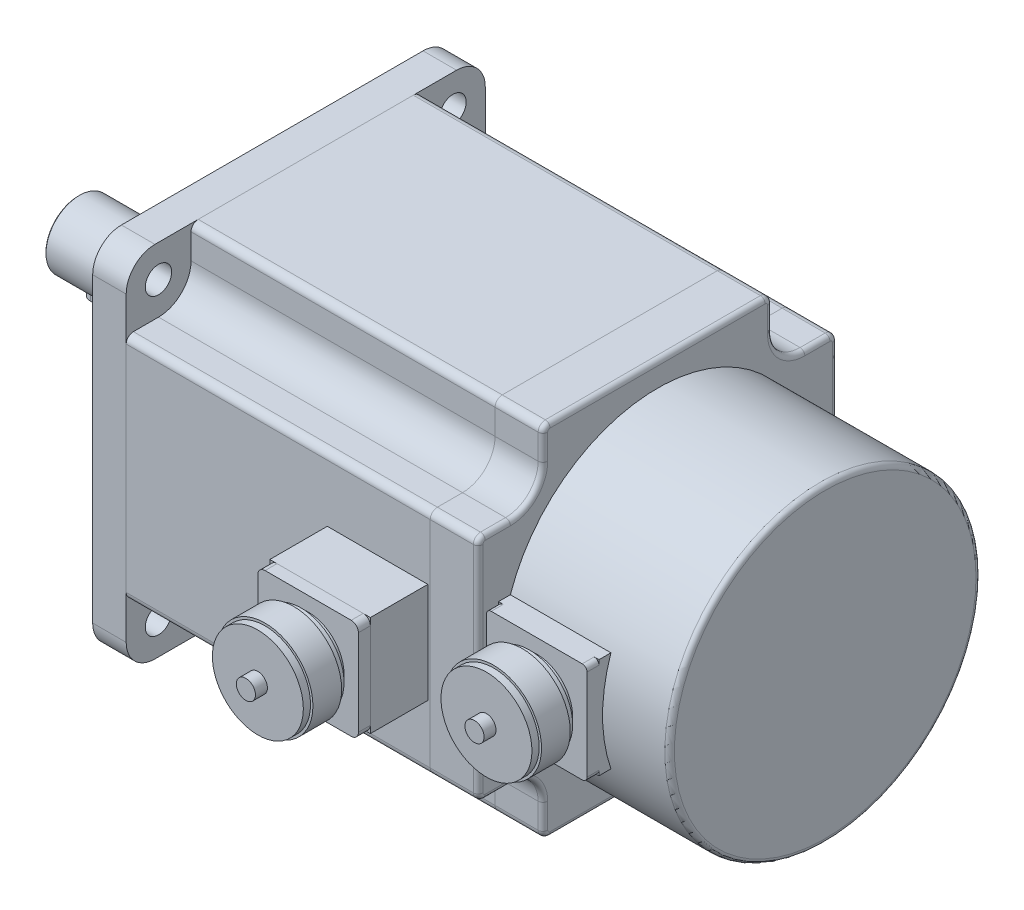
from build123d import *

# Parameters (mm, degrees)
EXTRUDE_1_DEPTH     = 20
EXTRUDE_2_DEPTH     = 127
EXTRUDE_3_DEPTH     = 14
SKETCH_4_W          = 42
SKETCH_4_H          = 42
EXTRUDE_4_DEPTH     = 24
EXTRUDE_5_DEPTH     = 5
SKETCH_6_R          = 15
EXTRUDE_6_DEPTH     = 3
SKETCH_7_R          = 18
EXTRUDE_7_DEPTH     = 3
SKETCH_8_R          = 20
EXTRUDE_8_DEPTH     = 12
SKETCH_9_R          = 19
EXTRUDE_9_DEPTH     = 3
SKETCH_10_R         = 4
EXTRUDE_10_DEPTH    = 5
CUT_EXTRUDE_START   = -147
CUT_EXTRUDE_2_DEPTH = 147
FILLET_1_R          = 2
SKETCH_12_R         = 5.5
CUT_EXTRUDE_3_DEPTH = 14
SKETCH_13_R         = 65
SKETCH_13_R_2       = 57.5
EXTRUDE_11_DEPTH    = 6
SKETCH_14_R         = 35
EXTRUDE_12_DEPTH    = 6
SKETCH_15_R         = 17.5
EXTRUDE_13_DEPTH    = 3
FILLET_2_R          = 0.5
SKETCH_16_R         = 14
EXTRUDE_14_DEPTH    = 72
CHAMFER_1_SIZE      = 0.5
SKETCH_19_R         = 65
EXTRUDE_16_DEPTH    = 70
FILLET_3_R          = 2
SKETCH_20_W         = 42
SKETCH_20_H         = 42
CUT_EXTRUDE_5_DEPTH = 10
SKETCH_21_W         = 42
SKETCH_21_H         = 42
EXTRUDE_17_DEPTH    = 11.5
EXTRUDE_18_DEPTH    = 5
SKETCH_23_R         = 15
EXTRUDE_19_DEPTH    = 3
SKETCH_24_R         = 18
EXTRUDE_20_DEPTH    = 3
SKETCH_25_R         = 20
EXTRUDE_21_DEPTH    = 12
SKETCH_26_R         = 19
EXTRUDE_22_DEPTH    = 3
SKETCH_27_R         = 4
EXTRUDE_23_DEPTH    = 5
CUT_EXTRUDE_6_DEPTH = 4
EXTRUDE_24_DEPTH    = 8


with BuildPart() as part:
    # Sketch 1 → Extrude 1 (new body)
    with BuildSketch(Plane(origin=(0, 0, 0), x_dir=(0, 0, -1), z_dir=(1, 0, 0))):
        with BuildLine():
            Line((-63, -75), (63, -75))
            ThreePointArc((63, -75), (71.485281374, -71.485281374), (75, -63))
            Line((75, -63), (75, 63))
            ThreePointArc((75, 63), (71.485281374, 71.485281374), (63, 75))
            Line((63, 75), (-63, 75))
            ThreePointArc((-63, 75), (-71.485281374, 71.485281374), (-75, 63))
            Line((-75, 63), (-75, -63))
            ThreePointArc((-75, -63), (-71.485281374, -71.485281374), (-63, -75))
        make_face()
    extrude(amount=EXTRUDE_1_DEPTH)


with BuildPart() as body_2:
    # Sketch 2 → Extrude 2 (new body)
    with BuildSketch(Plane.ZY):
        with BuildLine():
            Line((-63, -75), (63, -75))
            ThreePointArc((63, -75), (71.485281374, -71.485281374), (75, -63))
            Line((75, -63), (75, 63))
            ThreePointArc((75, 63), (71.485281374, 71.485281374), (63, 75))
            Line((63, 75), (-63, 75))
            ThreePointArc((-63, 75), (-71.485281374, 71.485281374), (-75, 63))
            Line((-75, 63), (-75, -63))
            ThreePointArc((-75, -63), (-71.485281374, -71.485281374), (-63, -75))
        make_face()
    extrude(amount=EXTRUDE_2_DEPTH)


with BuildPart() as body_3:
    # Sketch 3 → Extrude 3 (new body)
    with BuildSketch(Plane.ZY.offset(127)):
        with BuildLine():
            Line((-63, -75), (63, -75))
            ThreePointArc((63, -75), (71.485281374, -71.485281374), (75, -63))
            Line((75, -63), (75, 63))
            ThreePointArc((75, 63), (71.485281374, 71.485281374), (63, 75))
            Line((63, 75), (-63, 75))
            ThreePointArc((-63, 75), (-71.485281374, 71.485281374), (-75, 63))
            Line((-75, 63), (-75, -63))
            ThreePointArc((-75, -63), (-71.485281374, -71.485281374), (-63, -75))
        make_face()
    extrude(amount=EXTRUDE_3_DEPTH)

    # Sketch 12 → Cut-Extrude 3 (cut)
    with BuildSketch(Plane.ZY.offset(141)):
        with Locations((-61.518289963, 61.518289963)):
            Circle(SKETCH_12_R)
        with Locations((61.518289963, 61.518289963)):
            Circle(SKETCH_12_R)
        with Locations((-61.518289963, -61.518289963)):
            Circle(SKETCH_12_R)
        with Locations((61.518289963, -61.518289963)):
            Circle(SKETCH_12_R)
    extrude(amount=-CUT_EXTRUDE_3_DEPTH, mode=Mode.SUBTRACT)



with BuildPart() as body_4:
    # Sketch 4 → Extrude 4 (new body)
    with BuildSketch(Plane.XY.offset(75)):
        with Locations((-22, 0)):
            Rectangle(SKETCH_4_W, SKETCH_4_H)
    extrude(amount=EXTRUDE_4_DEPTH)


with BuildPart() as body_5:
    # Sketch 5 → Extrude 5 (new body)
    with BuildSketch(Plane.XY.offset(99)):
        with BuildLine():
            Line((-40, -21), (-4, -21))
            ThreePointArc((-4, -21), (-1.878679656, -20.121320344), (-1, -18))
            Line((-1, -18), (-1, 18))
            ThreePointArc((-1, 18), (-1.878679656, 20.121320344), (-4, 21))
            Line((-4, 21), (-40, 21))
            ThreePointArc((-40, 21), (-42.121320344, 20.121320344), (-43, 18))
            Line((-43, 18), (-43, -18))
            ThreePointArc((-43, -18), (-42.121320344, -20.121320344), (-40, -21))
        make_face()
    extrude(amount=EXTRUDE_5_DEPTH)


with BuildPart() as body_6:
    # Sketch 6 → Extrude 6 (new body)
    with BuildSketch(Plane.XY.offset(104)):
        with Locations((-22, 0)):
            Circle(SKETCH_6_R)
    extrude(amount=EXTRUDE_6_DEPTH)


with BuildPart() as body_7:
    # Sketch 7 → Extrude 7 (new body)
    with BuildSketch(Plane.XY.offset(107)):
        with Locations((-22, 0)):
            Circle(SKETCH_7_R)
    extrude(amount=EXTRUDE_7_DEPTH)


with BuildPart() as body_8:
    # Sketch 8 → Extrude 8 (new body)
    with BuildSketch(Plane.XY.offset(110)):
        with Locations((-22, 0)):
            Circle(SKETCH_8_R)
    extrude(amount=EXTRUDE_8_DEPTH)

    # Sketch 9 → Extrude 9 (add)
    with BuildSketch(Plane.XY.offset(122)):
        with Locations((-22, 0)):
            Circle(SKETCH_9_R)
    extrude(amount=EXTRUDE_9_DEPTH)

    # Sketch 10 → Extrude 10 (add)
    with BuildSketch(Plane.XY.offset(125)):
        with Locations((-22, 0)):
            Circle(SKETCH_10_R)
    extrude(amount=EXTRUDE_10_DEPTH)


with BuildPart() as cut_extrude_2_tool:
    # Sketch 11 → Cut-Extrude 2 (new body)
    with BuildSketch(Plane(origin=(20, 0, 0), x_dir=(0, 0, -1), z_dir=(1, 0, 0)).offset(CUT_EXTRUDE_START)):
        with BuildLine():
            Line((47.916922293, -61.5), (47.916922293, -72))
            ThreePointArc((47.916922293, -72), (47.038242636, -74.121320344), (44.916922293, -75))
            Line((44.916922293, -75), (63, -75))
            ThreePointArc((63, -75), (71.485281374, -71.485281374), (75, -63))
            Line((75, -63), (75, -44.916922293))
            ThreePointArc((75, -44.916922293), (74.121320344, -47.038242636), (72, -47.916922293))
            Line((72, -47.916922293), (61.5, -47.916922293))
            ThreePointArc((61.5, -47.916922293), (51.895313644, -51.895313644), (47.916922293, -61.5))
        make_face()
        with BuildLine():
            Line((-75, -44.916922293), (-75, -63))
            ThreePointArc((-75, -63), (-71.485281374, -71.485281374), (-63, -75))
            Line((-63, -75), (-44.916922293, -75))
            ThreePointArc((-44.916922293, -75), (-47.038242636, -74.121320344), (-47.916922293, -72))
            Line((-47.916922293, -72), (-47.916922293, -61.5))
            ThreePointArc((-47.916922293, -61.5), (-51.895313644, -51.895313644), (-61.5, -47.916922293))
            Line((-61.5, -47.916922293), (-72, -47.916922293))
            ThreePointArc((-72, -47.916922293), (-74.121320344, -47.038242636), (-75, -44.916922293))
        make_face()
        with BuildLine():
            Line((75, 63), (75, 44.916922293))
            ThreePointArc((75, 44.916922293), (74.121320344, 47.038242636), (72, 47.916922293))
            Line((72, 47.916922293), (61.5, 47.916922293))
            ThreePointArc((61.5, 47.916922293), (51.895313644, 51.895313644), (47.916922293, 61.5))
            Line((47.916922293, 61.5), (47.916922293, 72))
            ThreePointArc((47.916922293, 72), (47.038242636, 74.121320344), (44.916922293, 75))
            Line((44.916922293, 75), (63, 75))
            ThreePointArc((63, 75), (71.485281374, 71.485281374), (75, 63))
        make_face()
        with BuildLine():
            Line((-44.916922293, 75), (-63, 75))
            ThreePointArc((-63, 75), (-71.485281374, 71.485281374), (-75, 63))
            Line((-75, 63), (-75, 44.916922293))
            ThreePointArc((-75, 44.916922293), (-74.121320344, 47.038242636), (-72, 47.916922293))
            Line((-72, 47.916922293), (-61.5, 47.916922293))
            ThreePointArc((-61.5, 47.916922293), (-51.895313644, 51.895313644), (-47.916922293, 61.5))
            Line((-47.916922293, 61.5), (-47.916922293, 72))
            ThreePointArc((-47.916922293, 72), (-47.038242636, 74.121320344), (-44.916922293, 75))
        make_face()
    extrude(amount=CUT_EXTRUDE_2_DEPTH)


with BuildPart() as part_1:
    add(part.part)

    # Cut-Extrude 2: cut by cut_extrude_2_tool
    add(cut_extrude_2_tool.part, mode=Mode.SUBTRACT)

    # Fillet 1
    fillet_1_edges = [part_1.edges().sort_by_distance(p)[0] for p in [
        (20, 51.895313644, -51.895313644),
        (20, 47.916922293, -66.75),
        (20, 47.038242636, -74.121320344),
        (20, 74.121320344, -47.038242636),
        (20, 66.75, -47.916922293),
        (20, 0, -75),
        (20, 75, 0),
        (20, 0, 75),
        (20, -75, 0),
        (20, -47.038242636, 74.121320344),
        (20, -74.121320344, 47.038242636),
        (20, -66.75, 47.916922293),
        (20, -51.895313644, 51.895313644),
        (20, -47.916922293, 66.75),
        (20, -51.895313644, -51.895313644),
        (20, -66.75, -47.916922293),
        (20, -74.121320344, -47.038242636),
        (20, -47.038242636, -74.121320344),
        (20, -47.916922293, -66.75),
        (20, 47.038242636, 74.121320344),
        (20, 47.916922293, 66.75),
        (20, 51.895313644, 51.895313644),
        (20, 66.75, 47.916922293),
        (20, 74.121320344, 47.038242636),
    ]]
    fillet(fillet_1_edges, radius=FILLET_1_R)



with BuildPart() as body_2_1:
    add(body_2.part)

    # Cut-Extrude 2: cut by cut_extrude_2_tool
    add(cut_extrude_2_tool.part, mode=Mode.SUBTRACT)


with BuildPart() as body_9:
    # Sketch 13 → Extrude 11 (new body)
    with BuildSketch(Plane.ZY.offset(141)):
        Circle(SKETCH_13_R)
        Circle(SKETCH_13_R_2, mode=Mode.SUBTRACT)
    extrude(amount=EXTRUDE_11_DEPTH)


with BuildPart() as body_3_1:
    add(body_3.part)

    add(body_9.part)  # Extrude 12 merges body 9
    # Sketch 14 → Extrude 12 (add)
    with BuildSketch(Plane.ZY.offset(141)):
        with Locations(Location((0, 0, 0), (0, 0, 180))):
            Circle(SKETCH_14_R)
    extrude(amount=EXTRUDE_12_DEPTH)


with BuildPart() as body_9_2:
    # Sketch 15 → Extrude 13 (new body)
    with BuildSketch(Plane.ZY.offset(147)):
        Circle(SKETCH_15_R)
    extrude(amount=EXTRUDE_13_DEPTH)

    # Fillet 2
    fillet_2_edges = [body_9_2.edges().sort_by_distance(p)[0] for p in [
        (-150, 0, -17.5),
    ]]
    fillet(fillet_2_edges, radius=FILLET_2_R)

    # Sketch 16 → Extrude 14 (add)
    with BuildSketch(Plane.ZY.offset(150)):
        Circle(SKETCH_16_R)
    extrude(amount=EXTRUDE_14_DEPTH)

    # Chamfer 1
    chamfer_1_edges = [body_9_2.edges().sort_by_distance(p)[0] for p in [
        (-222, 0, -14),
    ]]
    chamfer(chamfer_1_edges, length=CHAMFER_1_SIZE)

    # Sketch 29 → Cut-Extrude 6 (cut)
    with BuildSketch(Plane(origin=(0, -14, 0), x_dir=(1, 0, 0), z_dir=(0, 1, 0))):
        with BuildLine():
            Line((-213, -4), (-166, -4))
            ThreePointArc((-166, -4), (-162, 0), (-166, 4))
            Line((-166, 4), (-213, 4))
            ThreePointArc((-213, 4), (-217, 0), (-213, -4))
        make_face()
    extrude(amount=CUT_EXTRUDE_6_DEPTH, mode=Mode.SUBTRACT)


with BuildPart() as body_10:
    # Sketch 19 → Extrude 16 (new body)
    with BuildSketch(Plane(origin=(20, 0, 0), x_dir=(0, 0, -1), z_dir=(1, 0, 0))):
        Circle(SKETCH_19_R)
    extrude(amount=EXTRUDE_16_DEPTH)

    # Fillet 3
    fillet_3_edges = [body_10.edges().sort_by_distance(p)[0] for p in [
        (90, 0, 65),
    ]]
    fillet(fillet_3_edges, radius=FILLET_3_R)

    # Sketch 20 → Cut-Extrude 5 (cut)
    with BuildSketch(Plane.XY.offset(65)):
        with Locations((41, 0)):
            Rectangle(SKETCH_20_W, SKETCH_20_H)
    extrude(amount=-CUT_EXTRUDE_5_DEPTH, mode=Mode.SUBTRACT)


with BuildPart() as part_2:
    add(part_1.part)

    add(body_10.part)  # Extrude 17 merges body 10
    # Sketch 21 → Extrude 17 (add)
    with BuildSketch(Plane.XY.offset(55)):
        with Locations((41, 0)):
            Rectangle(SKETCH_21_W, SKETCH_21_H)
    extrude(amount=EXTRUDE_17_DEPTH)



with BuildPart() as body_10_2:
    # Sketch 22 → Extrude 18 (new body)
    with BuildSketch(Plane.XY.offset(66.5)):
        with BuildLine():
            Line((22, -21), (60, -21))
            ThreePointArc((60, -21), (61.414213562, -20.414213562), (62, -19))
            Line((62, -19), (62, 19))
            ThreePointArc((62, 19), (61.414213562, 20.414213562), (60, 21))
            Line((60, 21), (22, 21))
            ThreePointArc((22, 21), (20.585786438, 20.414213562), (20, 19))
            Line((20, 19), (20, -19))
            ThreePointArc((20, -19), (20.585786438, -20.414213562), (22, -21))
        make_face()
    extrude(amount=EXTRUDE_18_DEPTH)


with BuildPart() as part_3:
    add(part_2.part)

    add(body_10_2.part)  # Extrude 19 merges body 10 2
    # Sketch 23 → Extrude 19 (add)
    with BuildSketch(Plane.XY.offset(71.5)):
        with Locations(Location((41, 0, 0), (0, 0, 180))):
            Circle(SKETCH_23_R)
    extrude(amount=EXTRUDE_19_DEPTH)

    # Sketch 24 → Extrude 20 (add)
    with BuildSketch(Plane.XY.offset(74.5)):
        with Locations((41, 0)):
            Circle(SKETCH_24_R)
    extrude(amount=EXTRUDE_20_DEPTH)

    # Sketch 25 → Extrude 21 (add)
    with BuildSketch(Plane.XY.offset(77.5)):
        with Locations((41, 0)):
            Circle(SKETCH_25_R)
    extrude(amount=EXTRUDE_21_DEPTH)

    # Sketch 26 → Extrude 22 (add)
    with BuildSketch(Plane.XY.offset(89.5)):
        with Locations((41, 0)):
            Circle(SKETCH_26_R)
    extrude(amount=EXTRUDE_22_DEPTH)

    # Sketch 27 → Extrude 23 (add)
    with BuildSketch(Plane.XY.offset(92.5)):
        with Locations((41, 0)):
            Circle(SKETCH_27_R)
    extrude(amount=EXTRUDE_23_DEPTH)


with BuildPart() as body_10_3:
    # Sketch 30 → Extrude 24 (new body)
    with BuildSketch(Plane.XZ.offset(10)):
        with BuildLine():
            Line((-213, 4), (-166, 4))
            ThreePointArc((-166, 4), (-162, 0), (-166, -4))
            Line((-166, -4), (-213, -4))
            ThreePointArc((-213, -4), (-217, 0), (-213, 4))
        make_face()
    extrude(amount=EXTRUDE_24_DEPTH)


solid = Compound([body_4.part, body_5.part, body_6.part, body_7.part, body_8.part, body_2_1.part, body_3_1.part, body_9_2.part, part_3.part, body_10_3.part])
